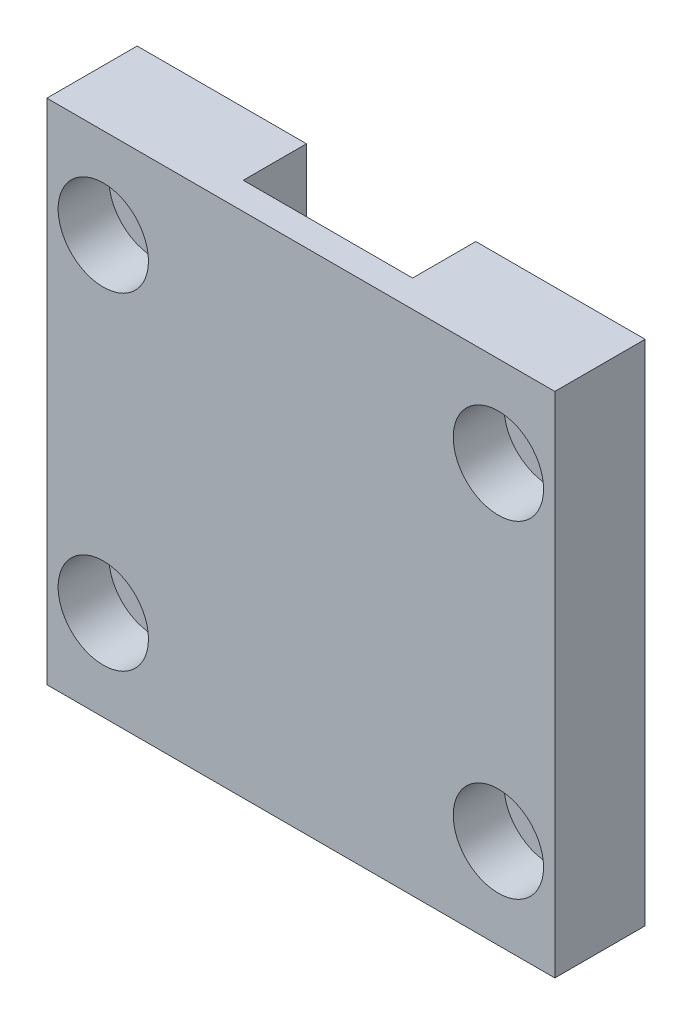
ISO-10303-21;
HEADER;
FILE_DESCRIPTION(('STEP AP214'),'2;1');
FILE_NAME('part.step','',(''),(''),'','','');
FILE_SCHEMA(('AUTOMOTIVE_DESIGN { 1 0 10303 214 1 1 1 1 }'));
ENDSEC;
DATA;
#1=APPLICATION_CONTEXT('core data for automotive mechanical design processes');
#2=APPLICATION_PROTOCOL_DEFINITION('international standard','automotive_design',2000,#1);
#3=PRODUCT_CONTEXT('',#1,'mechanical');
#4=PRODUCT('Part','Part','',(#3));
#5=PRODUCT_RELATED_PRODUCT_CATEGORY('part','',(#4));
#6=PRODUCT_DEFINITION_FORMATION('','',#4);
#7=PRODUCT_DEFINITION_CONTEXT('part definition',#1,'design');
#8=PRODUCT_DEFINITION('design','',#6,#7);
#9=PRODUCT_DEFINITION_SHAPE('','',#8);
#10=(LENGTH_UNIT() NAMED_UNIT(*) SI_UNIT(.MILLI.,.METRE.));
#11=(NAMED_UNIT(*) PLANE_ANGLE_UNIT() SI_UNIT($,.RADIAN.));
#12=(NAMED_UNIT(*) SI_UNIT($,.STERADIAN.) SOLID_ANGLE_UNIT());
#13=UNCERTAINTY_MEASURE_WITH_UNIT(LENGTH_MEASURE(1.E-05),#10,'distance_accuracy_value','');
#14=(GEOMETRIC_REPRESENTATION_CONTEXT(3) GLOBAL_UNCERTAINTY_ASSIGNED_CONTEXT((#13)) GLOBAL_UNIT_ASSIGNED_CONTEXT((#10,
#11,#12)) REPRESENTATION_CONTEXT('',''));
#15=CARTESIAN_POINT('',(0.,0.,0.));
#16=DIRECTION('',(0.,0.,1.));
#17=DIRECTION('',(1.,0.,0.));
#18=AXIS2_PLACEMENT_3D('',#15,#16,#17);
#19=CARTESIAN_POINT('',(0.,45.0000000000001,0.));
#20=DIRECTION('',(0.,0.,-1.));
#21=DIRECTION('',(-1.,0.,0.));
#22=AXIS2_PLACEMENT_3D('',#19,#20,#21);
#23=PLANE('',#22);
#24=CARTESIAN_POINT('',(5.,8.00000000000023,0.));
#25=DIRECTION('',(0.,0.,1.));
#26=DIRECTION('',(1.,0.,0.));
#27=AXIS2_PLACEMENT_3D('',#24,#25,#26);
#28=CIRCLE('',#27,2.25);
#29=CARTESIAN_POINT('',(7.25,8.00000000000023,0.));
#30=VERTEX_POINT('',#29);
#31=EDGE_CURVE('E139',#30,#30,#28,.T.);
#32=ORIENTED_EDGE('',*,*,#31,.T.);
#33=EDGE_LOOP('',(#32));
#34=FACE_BOUND('',#33,.T.);
#35=CARTESIAN_POINT('',(4.99999999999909,37.0000000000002,0.));
#36=DIRECTION('',(0.,0.,1.));
#37=DIRECTION('',(1.,0.,0.));
#38=AXIS2_PLACEMENT_3D('',#35,#36,#37);
#39=CIRCLE('',#38,2.25);
#40=CARTESIAN_POINT('',(7.24999999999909,37.0000000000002,0.));
#41=VERTEX_POINT('',#40);
#42=EDGE_CURVE('E189',#41,#41,#39,.T.);
#43=ORIENTED_EDGE('',*,*,#42,.T.);
#44=EDGE_LOOP('',(#43));
#45=FACE_BOUND('',#44,.T.);
#46=DIRECTION('',(-1.,0.,0.));
#47=VECTOR('',#46,1.);
#48=CARTESIAN_POINT('',(0.,45.0000000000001,0.));
#49=LINE('',#48,#47);
#50=CARTESIAN_POINT('',(15.,45.0000000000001,0.));
#51=VERTEX_POINT('',#50);
#52=CARTESIAN_POINT('',(0.,45.0000000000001,0.));
#53=VERTEX_POINT('',#52);
#54=EDGE_CURVE('E80',#51,#53,#49,.T.);
#55=ORIENTED_EDGE('',*,*,#54,.F.);
#56=DIRECTION('',(0.,1.,0.));
#57=VECTOR('',#56,1.);
#58=CARTESIAN_POINT('',(15.,1.11022302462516E-13,0.));
#59=LINE('',#58,#57);
#60=CARTESIAN_POINT('',(15.,1.11022302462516E-13,0.));
#61=VERTEX_POINT('',#60);
#62=EDGE_CURVE('E212',#61,#51,#59,.T.);
#63=ORIENTED_EDGE('',*,*,#62,.F.);
#64=DIRECTION('',(1.,0.,0.));
#65=VECTOR('',#64,1.);
#66=CARTESIAN_POINT('',(0.,1.13686837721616E-13,0.));
#67=LINE('',#66,#65);
#68=CARTESIAN_POINT('',(0.,1.13686837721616E-13,0.));
#69=VERTEX_POINT('',#68);
#70=EDGE_CURVE('E134',#69,#61,#67,.T.);
#71=ORIENTED_EDGE('',*,*,#70,.F.);
#72=DIRECTION('',(0.,-1.,0.));
#73=VECTOR('',#72,1.);
#74=CARTESIAN_POINT('',(0.,1.13686837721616E-13,0.));
#75=LINE('',#74,#73);
#76=EDGE_CURVE('E135',#53,#69,#75,.T.);
#77=ORIENTED_EDGE('',*,*,#76,.F.);
#78=EDGE_LOOP('',(#55,#63,#71,#77));
#79=FACE_BOUND('',#78,.T.);
#80=ADVANCED_FACE('F33',(#34,#45,#79),#23,.T.);
#81=CARTESIAN_POINT('',(40.,37.0000000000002,0.));
#82=DIRECTION('',(0.,0.,1.));
#83=DIRECTION('',(1.,0.,0.));
#84=AXIS2_PLACEMENT_3D('',#81,#82,#83);
#85=CIRCLE('',#84,2.25);
#86=CARTESIAN_POINT('',(42.25,37.0000000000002,0.));
#87=VERTEX_POINT('',#86);
#88=EDGE_CURVE('E156',#87,#87,#85,.T.);
#89=ORIENTED_EDGE('',*,*,#88,.T.);
#90=EDGE_LOOP('',(#89));
#91=FACE_BOUND('',#90,.T.);
#92=CARTESIAN_POINT('',(40.,8.00000000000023,0.));
#93=DIRECTION('',(0.,0.,1.));
#94=DIRECTION('',(1.,0.,0.));
#95=AXIS2_PLACEMENT_3D('',#92,#93,#94);
#96=CIRCLE('',#95,2.25);
#97=CARTESIAN_POINT('',(42.25,8.00000000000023,0.));
#98=VERTEX_POINT('',#97);
#99=EDGE_CURVE('E192',#98,#98,#96,.T.);
#100=ORIENTED_EDGE('',*,*,#99,.T.);
#101=EDGE_LOOP('',(#100));
#102=FACE_BOUND('',#101,.T.);
#103=CARTESIAN_POINT('',(30.,1.11022302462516E-13,0.));
#104=VERTEX_POINT('',#103);
#105=CARTESIAN_POINT('',(45.,1.13686837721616E-13,0.));
#106=VERTEX_POINT('',#105);
#107=EDGE_CURVE('E125',#104,#106,#67,.T.);
#108=ORIENTED_EDGE('',*,*,#107,.F.);
#109=DIRECTION('',(0.,1.,0.));
#110=VECTOR('',#109,1.);
#111=CARTESIAN_POINT('',(30.,1.11022302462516E-13,0.));
#112=LINE('',#111,#110);
#113=CARTESIAN_POINT('',(30.,45.0000000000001,0.));
#114=VERTEX_POINT('',#113);
#115=EDGE_CURVE('E109',#104,#114,#112,.T.);
#116=ORIENTED_EDGE('',*,*,#115,.T.);
#117=CARTESIAN_POINT('',(45.,45.0000000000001,0.));
#118=VERTEX_POINT('',#117);
#119=EDGE_CURVE('E144',#118,#114,#49,.T.);
#120=ORIENTED_EDGE('',*,*,#119,.F.);
#121=DIRECTION('',(0.,1.,0.));
#122=VECTOR('',#121,1.);
#123=CARTESIAN_POINT('',(45.,1.13686837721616E-13,0.));
#124=LINE('',#123,#122);
#125=EDGE_CURVE('E133',#106,#118,#124,.T.);
#126=ORIENTED_EDGE('',*,*,#125,.F.);
#127=EDGE_LOOP('',(#108,#116,#120,#126));
#128=FACE_BOUND('',#127,.T.);
#129=ADVANCED_FACE('F132',(#91,#102,#128),#23,.T.);
#130=CARTESIAN_POINT('',(0.,1.13686837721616E-13,8.));
#131=DIRECTION('',(0.,1.,0.));
#132=DIRECTION('',(0.,0.,1.));
#133=AXIS2_PLACEMENT_3D('',#130,#131,#132);
#134=PLANE('',#133);
#135=DIRECTION('',(0.,0.,-1.));
#136=VECTOR('',#135,1.);
#137=CARTESIAN_POINT('',(15.,1.11022302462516E-13,5.59999999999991));
#138=LINE('',#137,#136);
#139=CARTESIAN_POINT('',(15.,1.11022302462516E-13,5.59999999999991));
#140=VERTEX_POINT('',#139);
#141=EDGE_CURVE('E121',#140,#61,#138,.T.);
#142=ORIENTED_EDGE('',*,*,#141,.F.);
#143=DIRECTION('',(-1.,0.,0.));
#144=VECTOR('',#143,1.);
#145=CARTESIAN_POINT('',(15.,1.11022302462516E-13,5.59999999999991));
#146=LINE('',#145,#144);
#147=CARTESIAN_POINT('',(29.9999999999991,1.11022302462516E-13,5.59999999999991));
#148=VERTEX_POINT('',#147);
#149=EDGE_CURVE('E128',#148,#140,#146,.T.);
#150=ORIENTED_EDGE('',*,*,#149,.F.);
#151=DIRECTION('',(-1.62320553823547E-13,0.,1.));
#152=VECTOR('',#151,1.);
#153=CARTESIAN_POINT('',(29.9999999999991,1.11022302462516E-13,5.59999999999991));
#154=LINE('',#153,#152);
#155=EDGE_CURVE('E112',#104,#148,#154,.T.);
#156=ORIENTED_EDGE('',*,*,#155,.F.);
#157=ORIENTED_EDGE('',*,*,#107,.T.);
#158=DIRECTION('',(0.,0.,-1.));
#159=VECTOR('',#158,1.);
#160=CARTESIAN_POINT('',(45.,1.13686837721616E-13,8.));
#161=LINE('',#160,#159);
#162=CARTESIAN_POINT('',(45.,1.13686837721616E-13,8.));
#163=VERTEX_POINT('',#162);
#164=EDGE_CURVE('E42',#163,#106,#161,.T.);
#165=ORIENTED_EDGE('',*,*,#164,.F.);
#166=DIRECTION('',(1.,0.,0.));
#167=VECTOR('',#166,1.);
#168=CARTESIAN_POINT('',(0.,1.13686837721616E-13,8.));
#169=LINE('',#168,#167);
#170=CARTESIAN_POINT('',(0.,1.13686837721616E-13,8.));
#171=VERTEX_POINT('',#170);
#172=EDGE_CURVE('E87',#171,#163,#169,.T.);
#173=ORIENTED_EDGE('',*,*,#172,.F.);
#174=DIRECTION('',(0.,0.,-1.));
#175=VECTOR('',#174,1.);
#176=CARTESIAN_POINT('',(0.,1.13686837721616E-13,8.));
#177=LINE('',#176,#175);
#178=EDGE_CURVE('E12',#171,#69,#177,.T.);
#179=ORIENTED_EDGE('',*,*,#178,.T.);
#180=ORIENTED_EDGE('',*,*,#70,.T.);
#181=EDGE_LOOP('',(#142,#150,#156,#157,#165,#173,#179,#180));
#182=FACE_BOUND('',#181,.T.);
#183=ADVANCED_FACE('F124',(#182),#134,.F.);
#184=CARTESIAN_POINT('',(0.,45.0000000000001,8.));
#185=DIRECTION('',(0.,-1.,0.));
#186=DIRECTION('',(0.,0.,-1.));
#187=AXIS2_PLACEMENT_3D('',#184,#185,#186);
#188=PLANE('',#187);
#189=DIRECTION('',(0.,0.,-1.));
#190=VECTOR('',#189,1.);
#191=CARTESIAN_POINT('',(15.,45.0000000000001,5.59999999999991));
#192=LINE('',#191,#190);
#193=CARTESIAN_POINT('',(15.,45.0000000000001,5.59999999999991));
#194=VERTEX_POINT('',#193);
#195=EDGE_CURVE('E129',#194,#51,#192,.T.);
#196=ORIENTED_EDGE('',*,*,#195,.T.);
#197=ORIENTED_EDGE('',*,*,#54,.T.);
#198=DIRECTION('',(0.,0.,-1.));
#199=VECTOR('',#198,1.);
#200=CARTESIAN_POINT('',(0.,45.0000000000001,8.));
#201=LINE('',#200,#199);
#202=CARTESIAN_POINT('',(0.,45.0000000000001,8.));
#203=VERTEX_POINT('',#202);
#204=EDGE_CURVE('E147',#203,#53,#201,.T.);
#205=ORIENTED_EDGE('',*,*,#204,.F.);
#206=DIRECTION('',(-1.,0.,0.));
#207=VECTOR('',#206,1.);
#208=CARTESIAN_POINT('',(0.,45.0000000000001,8.));
#209=LINE('',#208,#207);
#210=CARTESIAN_POINT('',(45.,45.0000000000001,8.));
#211=VERTEX_POINT('',#210);
#212=EDGE_CURVE('E59',#211,#203,#209,.T.);
#213=ORIENTED_EDGE('',*,*,#212,.F.);
#214=DIRECTION('',(0.,0.,-1.));
#215=VECTOR('',#214,1.);
#216=CARTESIAN_POINT('',(45.,45.0000000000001,8.));
#217=LINE('',#216,#215);
#218=EDGE_CURVE('E149',#211,#118,#217,.T.);
#219=ORIENTED_EDGE('',*,*,#218,.T.);
#220=ORIENTED_EDGE('',*,*,#119,.T.);
#221=DIRECTION('',(-1.62320553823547E-13,0.,1.));
#222=VECTOR('',#221,1.);
#223=CARTESIAN_POINT('',(29.9999999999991,45.0000000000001,5.59999999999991));
#224=LINE('',#223,#222);
#225=CARTESIAN_POINT('',(29.9999999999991,45.0000000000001,5.59999999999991));
#226=VERTEX_POINT('',#225);
#227=EDGE_CURVE('E115',#114,#226,#224,.T.);
#228=ORIENTED_EDGE('',*,*,#227,.T.);
#229=DIRECTION('',(-1.,0.,0.));
#230=VECTOR('',#229,1.);
#231=CARTESIAN_POINT('',(15.,45.0000000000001,5.59999999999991));
#232=LINE('',#231,#230);
#233=EDGE_CURVE('E50',#226,#194,#232,.T.);
#234=ORIENTED_EDGE('',*,*,#233,.T.);
#235=EDGE_LOOP('',(#196,#197,#205,#213,#219,#220,#228,#234));
#236=FACE_BOUND('',#235,.T.);
#237=ADVANCED_FACE('F205',(#236),#188,.F.);
#238=CARTESIAN_POINT('',(40.,37.0000000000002,8.));
#239=DIRECTION('',(0.,0.,-1.));
#240=DIRECTION('',(-1.,0.,0.));
#241=AXIS2_PLACEMENT_3D('',#238,#239,#240);
#242=CYLINDRICAL_SURFACE('',#241,2.25);
#243=ORIENTED_EDGE('',*,*,#88,.F.);
#244=EDGE_LOOP('',(#243));
#245=FACE_BOUND('',#244,.T.);
#246=CARTESIAN_POINT('',(40.,37.0000000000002,3.5));
#247=DIRECTION('',(0.,0.,1.));
#248=DIRECTION('',(1.,0.,0.));
#249=AXIS2_PLACEMENT_3D('',#246,#247,#248);
#250=CIRCLE('',#249,2.25);
#251=CARTESIAN_POINT('',(42.25,37.0000000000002,3.5));
#252=VERTEX_POINT('',#251);
#253=EDGE_CURVE('E37',#252,#252,#250,.T.);
#254=ORIENTED_EDGE('',*,*,#253,.T.);
#255=EDGE_LOOP('',(#254));
#256=FACE_BOUND('',#255,.T.);
#257=ADVANCED_FACE('F229',(#245,#256),#242,.F.);
#258=CARTESIAN_POINT('',(4.99999999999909,37.0000000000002,8.));
#259=DIRECTION('',(0.,0.,-1.));
#260=DIRECTION('',(-1.,0.,0.));
#261=AXIS2_PLACEMENT_3D('',#258,#259,#260);
#262=CYLINDRICAL_SURFACE('',#261,2.25);
#263=ORIENTED_EDGE('',*,*,#42,.F.);
#264=EDGE_LOOP('',(#263));
#265=FACE_BOUND('',#264,.T.);
#266=CARTESIAN_POINT('',(4.99999999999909,37.0000000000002,3.5));
#267=DIRECTION('',(0.,0.,1.));
#268=DIRECTION('',(1.,0.,0.));
#269=AXIS2_PLACEMENT_3D('',#266,#267,#268);
#270=CIRCLE('',#269,2.25);
#271=CARTESIAN_POINT('',(7.24999999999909,37.0000000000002,3.5));
#272=VERTEX_POINT('',#271);
#273=EDGE_CURVE('E162',#272,#272,#270,.T.);
#274=ORIENTED_EDGE('',*,*,#273,.T.);
#275=EDGE_LOOP('',(#274));
#276=FACE_BOUND('',#275,.T.);
#277=ADVANCED_FACE('F277',(#265,#276),#262,.F.);
#278=CARTESIAN_POINT('',(40.,8.00000000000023,8.));
#279=DIRECTION('',(0.,0.,-1.));
#280=DIRECTION('',(-1.,0.,0.));
#281=AXIS2_PLACEMENT_3D('',#278,#279,#280);
#282=CYLINDRICAL_SURFACE('',#281,2.25);
#283=ORIENTED_EDGE('',*,*,#99,.F.);
#284=EDGE_LOOP('',(#283));
#285=FACE_BOUND('',#284,.T.);
#286=CARTESIAN_POINT('',(40.,8.00000000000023,3.5));
#287=DIRECTION('',(0.,0.,1.));
#288=DIRECTION('',(1.,0.,0.));
#289=AXIS2_PLACEMENT_3D('',#286,#287,#288);
#290=CIRCLE('',#289,2.25);
#291=CARTESIAN_POINT('',(42.25,8.00000000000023,3.5));
#292=VERTEX_POINT('',#291);
#293=EDGE_CURVE('E158',#292,#292,#290,.T.);
#294=ORIENTED_EDGE('',*,*,#293,.T.);
#295=EDGE_LOOP('',(#294));
#296=FACE_BOUND('',#295,.T.);
#297=ADVANCED_FACE('F286',(#285,#296),#282,.F.);
#298=CARTESIAN_POINT('',(5.,8.00000000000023,8.));
#299=DIRECTION('',(0.,0.,-1.));
#300=DIRECTION('',(-1.,0.,0.));
#301=AXIS2_PLACEMENT_3D('',#298,#299,#300);
#302=CYLINDRICAL_SURFACE('',#301,2.25);
#303=ORIENTED_EDGE('',*,*,#31,.F.);
#304=EDGE_LOOP('',(#303));
#305=FACE_BOUND('',#304,.T.);
#306=CARTESIAN_POINT('',(5.,8.00000000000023,3.5));
#307=DIRECTION('',(0.,0.,1.));
#308=DIRECTION('',(1.,0.,0.));
#309=AXIS2_PLACEMENT_3D('',#306,#307,#308);
#310=CIRCLE('',#309,2.25);
#311=CARTESIAN_POINT('',(7.25,8.00000000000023,3.5));
#312=VERTEX_POINT('',#311);
#313=EDGE_CURVE('E153',#312,#312,#310,.T.);
#314=ORIENTED_EDGE('',*,*,#313,.T.);
#315=EDGE_LOOP('',(#314));
#316=FACE_BOUND('',#315,.T.);
#317=ADVANCED_FACE('F294',(#305,#316),#302,.F.);
#318=CARTESIAN_POINT('',(0.,45.0000000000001,8.));
#319=DIRECTION('',(0.,0.,-1.));
#320=DIRECTION('',(-1.,0.,0.));
#321=AXIS2_PLACEMENT_3D('',#318,#319,#320);
#322=PLANE('',#321);
#323=CARTESIAN_POINT('',(40.,37.0000000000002,8.));
#324=DIRECTION('',(0.,0.,1.));
#325=DIRECTION('',(1.,0.,0.));
#326=AXIS2_PLACEMENT_3D('',#323,#324,#325);
#327=CIRCLE('',#326,4.);
#328=CARTESIAN_POINT('',(44.,37.0000000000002,8.));
#329=VERTEX_POINT('',#328);
#330=EDGE_CURVE('E178',#329,#329,#327,.T.);
#331=ORIENTED_EDGE('',*,*,#330,.F.);
#332=EDGE_LOOP('',(#331));
#333=FACE_BOUND('',#332,.T.);
#334=CARTESIAN_POINT('',(4.99999999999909,37.0000000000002,8.));
#335=DIRECTION('',(0.,0.,1.));
#336=DIRECTION('',(1.,0.,0.));
#337=AXIS2_PLACEMENT_3D('',#334,#335,#336);
#338=CIRCLE('',#337,4.);
#339=CARTESIAN_POINT('',(8.99999999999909,37.0000000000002,8.));
#340=VERTEX_POINT('',#339);
#341=EDGE_CURVE('E171',#340,#340,#338,.T.);
#342=ORIENTED_EDGE('',*,*,#341,.F.);
#343=EDGE_LOOP('',(#342));
#344=FACE_BOUND('',#343,.T.);
#345=CARTESIAN_POINT('',(40.,8.00000000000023,8.));
#346=DIRECTION('',(0.,0.,1.));
#347=DIRECTION('',(1.,0.,0.));
#348=AXIS2_PLACEMENT_3D('',#345,#346,#347);
#349=CIRCLE('',#348,4.);
#350=CARTESIAN_POINT('',(44.,8.00000000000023,8.));
#351=VERTEX_POINT('',#350);
#352=EDGE_CURVE('E164',#351,#351,#349,.T.);
#353=ORIENTED_EDGE('',*,*,#352,.F.);
#354=EDGE_LOOP('',(#353));
#355=FACE_BOUND('',#354,.T.);
#356=CARTESIAN_POINT('',(5.,8.00000000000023,8.));
#357=DIRECTION('',(0.,0.,1.));
#358=DIRECTION('',(1.,0.,0.));
#359=AXIS2_PLACEMENT_3D('',#356,#357,#358);
#360=CIRCLE('',#359,4.);
#361=CARTESIAN_POINT('',(9.,8.00000000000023,8.));
#362=VERTEX_POINT('',#361);
#363=EDGE_CURVE('E160',#362,#362,#360,.T.);
#364=ORIENTED_EDGE('',*,*,#363,.F.);
#365=EDGE_LOOP('',(#364));
#366=FACE_BOUND('',#365,.T.);
#367=DIRECTION('',(0.,-1.,0.));
#368=VECTOR('',#367,1.);
#369=CARTESIAN_POINT('',(0.,1.13686837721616E-13,8.));
#370=LINE('',#369,#368);
#371=EDGE_CURVE('E146',#203,#171,#370,.T.);
#372=ORIENTED_EDGE('',*,*,#371,.T.);
#373=ORIENTED_EDGE('',*,*,#172,.T.);
#374=DIRECTION('',(0.,1.,0.));
#375=VECTOR('',#374,1.);
#376=CARTESIAN_POINT('',(45.,1.13686837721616E-13,8.));
#377=LINE('',#376,#375);
#378=EDGE_CURVE('E199',#163,#211,#377,.T.);
#379=ORIENTED_EDGE('',*,*,#378,.T.);
#380=ORIENTED_EDGE('',*,*,#212,.T.);
#381=EDGE_LOOP('',(#372,#373,#379,#380));
#382=FACE_BOUND('',#381,.T.);
#383=ADVANCED_FACE('F202',(#333,#344,#355,#366,#382),#322,.F.);
#384=CARTESIAN_POINT('',(0.,1.13686837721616E-13,8.));
#385=DIRECTION('',(1.,0.,0.));
#386=DIRECTION('',(0.,0.,-1.));
#387=AXIS2_PLACEMENT_3D('',#384,#385,#386);
#388=PLANE('',#387);
#389=ORIENTED_EDGE('',*,*,#76,.T.);
#390=ORIENTED_EDGE('',*,*,#178,.F.);
#391=ORIENTED_EDGE('',*,*,#371,.F.);
#392=ORIENTED_EDGE('',*,*,#204,.T.);
#393=EDGE_LOOP('',(#389,#390,#391,#392));
#394=FACE_BOUND('',#393,.T.);
#395=ADVANCED_FACE('F35',(#394),#388,.F.);
#396=CARTESIAN_POINT('',(45.,1.13686837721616E-13,8.));
#397=DIRECTION('',(-1.,0.,0.));
#398=DIRECTION('',(0.,0.,1.));
#399=AXIS2_PLACEMENT_3D('',#396,#397,#398);
#400=PLANE('',#399);
#401=ORIENTED_EDGE('',*,*,#125,.T.);
#402=ORIENTED_EDGE('',*,*,#218,.F.);
#403=ORIENTED_EDGE('',*,*,#378,.F.);
#404=ORIENTED_EDGE('',*,*,#164,.T.);
#405=EDGE_LOOP('',(#401,#402,#403,#404));
#406=FACE_BOUND('',#405,.T.);
#407=ADVANCED_FACE('F204',(#406),#400,.F.);
#408=CARTESIAN_POINT('',(5.,8.00000000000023,3.5));
#409=DIRECTION('',(0.,0.,1.));
#410=DIRECTION('',(1.,0.,0.));
#411=AXIS2_PLACEMENT_3D('',#408,#409,#410);
#412=CYLINDRICAL_SURFACE('',#411,4.);
#413=CARTESIAN_POINT('',(5.,8.00000000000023,3.5));
#414=DIRECTION('',(0.,0.,1.));
#415=DIRECTION('',(1.,0.,0.));
#416=AXIS2_PLACEMENT_3D('',#413,#414,#415);
#417=CIRCLE('',#416,4.);
#418=CARTESIAN_POINT('',(9.,8.00000000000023,3.5));
#419=VERTEX_POINT('',#418);
#420=EDGE_CURVE('E157',#419,#419,#417,.T.);
#421=ORIENTED_EDGE('',*,*,#420,.F.);
#422=EDGE_LOOP('',(#421));
#423=FACE_BOUND('',#422,.T.);
#424=ORIENTED_EDGE('',*,*,#363,.T.);
#425=EDGE_LOOP('',(#424));
#426=FACE_BOUND('',#425,.T.);
#427=ADVANCED_FACE('F260',(#423,#426),#412,.F.);
#428=CARTESIAN_POINT('',(5.,8.00000000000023,3.5));
#429=DIRECTION('',(0.,0.,1.));
#430=DIRECTION('',(1.,0.,0.));
#431=AXIS2_PLACEMENT_3D('',#428,#429,#430);
#432=PLANE('',#431);
#433=ORIENTED_EDGE('',*,*,#313,.F.);
#434=EDGE_LOOP('',(#433));
#435=FACE_BOUND('',#434,.T.);
#436=ORIENTED_EDGE('',*,*,#420,.T.);
#437=EDGE_LOOP('',(#436));
#438=FACE_BOUND('',#437,.T.);
#439=ADVANCED_FACE('F322',(#435,#438),#432,.T.);
#440=CARTESIAN_POINT('',(40.,8.00000000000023,3.5));
#441=DIRECTION('',(0.,0.,1.));
#442=DIRECTION('',(1.,0.,0.));
#443=AXIS2_PLACEMENT_3D('',#440,#441,#442);
#444=CYLINDRICAL_SURFACE('',#443,4.);
#445=CARTESIAN_POINT('',(40.,8.00000000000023,3.5));
#446=DIRECTION('',(0.,0.,1.));
#447=DIRECTION('',(1.,0.,0.));
#448=AXIS2_PLACEMENT_3D('',#445,#446,#447);
#449=CIRCLE('',#448,4.);
#450=CARTESIAN_POINT('',(44.,8.00000000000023,3.5));
#451=VERTEX_POINT('',#450);
#452=EDGE_CURVE('E161',#451,#451,#449,.T.);
#453=ORIENTED_EDGE('',*,*,#452,.F.);
#454=EDGE_LOOP('',(#453));
#455=FACE_BOUND('',#454,.T.);
#456=ORIENTED_EDGE('',*,*,#352,.T.);
#457=EDGE_LOOP('',(#456));
#458=FACE_BOUND('',#457,.T.);
#459=ADVANCED_FACE('F330',(#455,#458),#444,.F.);
#460=CARTESIAN_POINT('',(40.,8.00000000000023,3.5));
#461=DIRECTION('',(0.,0.,1.));
#462=DIRECTION('',(1.,0.,0.));
#463=AXIS2_PLACEMENT_3D('',#460,#461,#462);
#464=PLANE('',#463);
#465=ORIENTED_EDGE('',*,*,#293,.F.);
#466=EDGE_LOOP('',(#465));
#467=FACE_BOUND('',#466,.T.);
#468=ORIENTED_EDGE('',*,*,#452,.T.);
#469=EDGE_LOOP('',(#468));
#470=FACE_BOUND('',#469,.T.);
#471=ADVANCED_FACE('F338',(#467,#470),#464,.T.);
#472=CARTESIAN_POINT('',(4.99999999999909,37.0000000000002,3.5));
#473=DIRECTION('',(0.,0.,1.));
#474=DIRECTION('',(1.,0.,0.));
#475=AXIS2_PLACEMENT_3D('',#472,#473,#474);
#476=CYLINDRICAL_SURFACE('',#475,4.);
#477=CARTESIAN_POINT('',(4.99999999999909,37.0000000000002,3.5));
#478=DIRECTION('',(0.,0.,1.));
#479=DIRECTION('',(1.,0.,0.));
#480=AXIS2_PLACEMENT_3D('',#477,#478,#479);
#481=CIRCLE('',#480,4.);
#482=CARTESIAN_POINT('',(8.99999999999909,37.0000000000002,3.5));
#483=VERTEX_POINT('',#482);
#484=EDGE_CURVE('E165',#483,#483,#481,.T.);
#485=ORIENTED_EDGE('',*,*,#484,.F.);
#486=EDGE_LOOP('',(#485));
#487=FACE_BOUND('',#486,.T.);
#488=ORIENTED_EDGE('',*,*,#341,.T.);
#489=EDGE_LOOP('',(#488));
#490=FACE_BOUND('',#489,.T.);
#491=ADVANCED_FACE('F346',(#487,#490),#476,.F.);
#492=CARTESIAN_POINT('',(4.99999999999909,37.0000000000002,3.5));
#493=DIRECTION('',(0.,0.,1.));
#494=DIRECTION('',(1.,0.,0.));
#495=AXIS2_PLACEMENT_3D('',#492,#493,#494);
#496=PLANE('',#495);
#497=ORIENTED_EDGE('',*,*,#273,.F.);
#498=EDGE_LOOP('',(#497));
#499=FACE_BOUND('',#498,.T.);
#500=ORIENTED_EDGE('',*,*,#484,.T.);
#501=EDGE_LOOP('',(#500));
#502=FACE_BOUND('',#501,.T.);
#503=ADVANCED_FACE('F242',(#499,#502),#496,.T.);
#504=CARTESIAN_POINT('',(40.,37.0000000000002,3.5));
#505=DIRECTION('',(0.,0.,1.));
#506=DIRECTION('',(1.,0.,0.));
#507=AXIS2_PLACEMENT_3D('',#504,#505,#506);
#508=CYLINDRICAL_SURFACE('',#507,4.);
#509=CARTESIAN_POINT('',(40.,37.0000000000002,3.5));
#510=DIRECTION('',(0.,0.,1.));
#511=DIRECTION('',(1.,0.,0.));
#512=AXIS2_PLACEMENT_3D('',#509,#510,#511);
#513=CIRCLE('',#512,4.);
#514=CARTESIAN_POINT('',(44.,37.0000000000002,3.5));
#515=VERTEX_POINT('',#514);
#516=EDGE_CURVE('E218',#515,#515,#513,.T.);
#517=ORIENTED_EDGE('',*,*,#516,.F.);
#518=EDGE_LOOP('',(#517));
#519=FACE_BOUND('',#518,.T.);
#520=ORIENTED_EDGE('',*,*,#330,.T.);
#521=EDGE_LOOP('',(#520));
#522=FACE_BOUND('',#521,.T.);
#523=ADVANCED_FACE('F234',(#519,#522),#508,.F.);
#524=CARTESIAN_POINT('',(40.,37.0000000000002,3.5));
#525=DIRECTION('',(0.,0.,1.));
#526=DIRECTION('',(1.,0.,0.));
#527=AXIS2_PLACEMENT_3D('',#524,#525,#526);
#528=PLANE('',#527);
#529=ORIENTED_EDGE('',*,*,#253,.F.);
#530=EDGE_LOOP('',(#529));
#531=FACE_BOUND('',#530,.T.);
#532=ORIENTED_EDGE('',*,*,#516,.T.);
#533=EDGE_LOOP('',(#532));
#534=FACE_BOUND('',#533,.T.);
#535=ADVANCED_FACE('F231',(#531,#534),#528,.T.);
#536=CARTESIAN_POINT('',(15.,1.11022302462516E-13,5.59999999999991));
#537=DIRECTION('',(1.,0.,0.));
#538=DIRECTION('',(0.,0.,-1.));
#539=AXIS2_PLACEMENT_3D('',#536,#537,#538);
#540=PLANE('',#539);
#541=ORIENTED_EDGE('',*,*,#195,.F.);
#542=DIRECTION('',(0.,1.,0.));
#543=VECTOR('',#542,1.);
#544=CARTESIAN_POINT('',(15.,1.11022302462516E-13,5.59999999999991));
#545=LINE('',#544,#543);
#546=EDGE_CURVE('E215',#140,#194,#545,.T.);
#547=ORIENTED_EDGE('',*,*,#546,.F.);
#548=ORIENTED_EDGE('',*,*,#141,.T.);
#549=ORIENTED_EDGE('',*,*,#62,.T.);
#550=EDGE_LOOP('',(#541,#547,#548,#549));
#551=FACE_BOUND('',#550,.T.);
#552=ADVANCED_FACE('F233',(#551),#540,.T.);
#553=CARTESIAN_POINT('',(15.,1.11022302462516E-13,5.59999999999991));
#554=DIRECTION('',(0.,0.,-1.));
#555=DIRECTION('',(-1.,0.,0.));
#556=AXIS2_PLACEMENT_3D('',#553,#554,#555);
#557=PLANE('',#556);
#558=ORIENTED_EDGE('',*,*,#233,.F.);
#559=DIRECTION('',(0.,1.,0.));
#560=VECTOR('',#559,1.);
#561=CARTESIAN_POINT('',(29.9999999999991,1.11022302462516E-13,5.59999999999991));
#562=LINE('',#561,#560);
#563=EDGE_CURVE('E120',#148,#226,#562,.T.);
#564=ORIENTED_EDGE('',*,*,#563,.F.);
#565=ORIENTED_EDGE('',*,*,#149,.T.);
#566=ORIENTED_EDGE('',*,*,#546,.T.);
#567=EDGE_LOOP('',(#558,#564,#565,#566));
#568=FACE_BOUND('',#567,.T.);
#569=ADVANCED_FACE('F240',(#568),#557,.T.);
#570=CARTESIAN_POINT('',(29.9999999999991,1.11022302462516E-13,5.59999999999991));
#571=DIRECTION('',(-1.,0.,-1.62320553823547E-13));
#572=DIRECTION('',(-1.62320553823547E-13,0.,1.));
#573=AXIS2_PLACEMENT_3D('',#570,#571,#572);
#574=PLANE('',#573);
#575=ORIENTED_EDGE('',*,*,#227,.F.);
#576=ORIENTED_EDGE('',*,*,#115,.F.);
#577=ORIENTED_EDGE('',*,*,#155,.T.);
#578=ORIENTED_EDGE('',*,*,#563,.T.);
#579=EDGE_LOOP('',(#575,#576,#577,#578));
#580=FACE_BOUND('',#579,.T.);
#581=ADVANCED_FACE('F111',(#580),#574,.T.);
#582=CLOSED_SHELL('',(#80,#129,#183,#237,#257,#277,#297,#317,#383,#395,#407,#427,#439,#459,#471,
#491,#503,#523,#535,#552,#569,#581));
#583=MANIFOLD_SOLID_BREP('B2',#582);
#584=ADVANCED_BREP_SHAPE_REPRESENTATION('',(#18,#583),#14);
#585=SHAPE_DEFINITION_REPRESENTATION(#9,#584);
ENDSEC;
END-ISO-10303-21;
